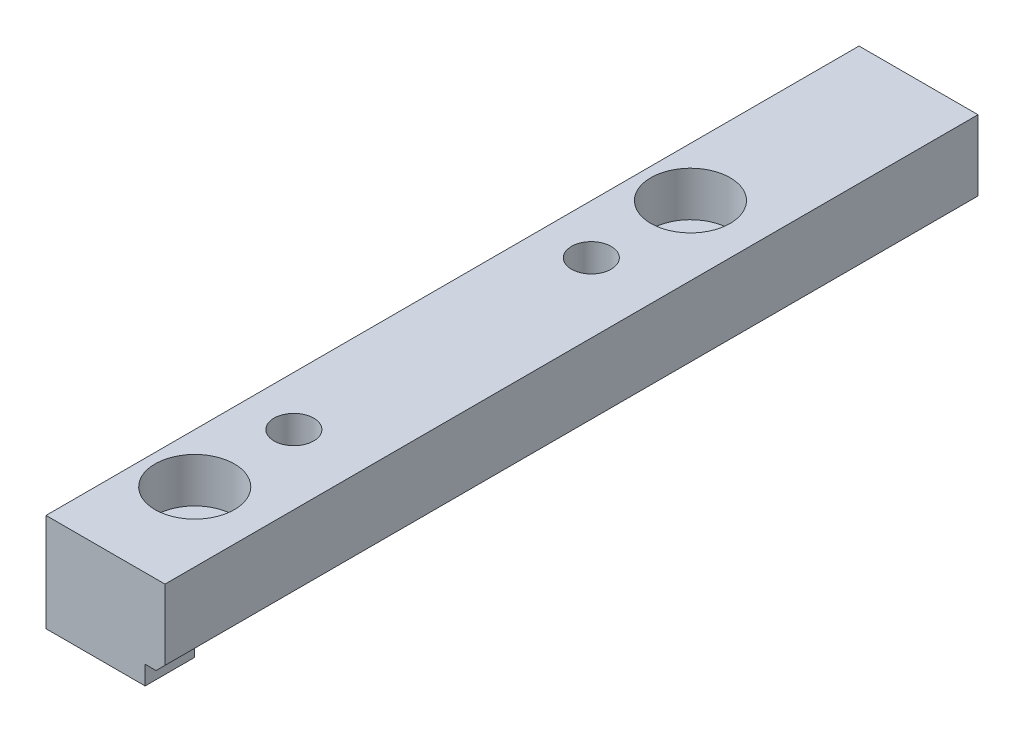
ISO-10303-21;
HEADER;
FILE_DESCRIPTION(('STEP AP214'),'2;1');
FILE_NAME('part.step','',(''),(''),'','','');
FILE_SCHEMA(('AUTOMOTIVE_DESIGN { 1 0 10303 214 1 1 1 1 }'));
ENDSEC;
DATA;
#1=APPLICATION_CONTEXT('core data for automotive mechanical design processes');
#2=APPLICATION_PROTOCOL_DEFINITION('international standard','automotive_design',2000,#1);
#3=PRODUCT_CONTEXT('',#1,'mechanical');
#4=PRODUCT('Part','Part','',(#3));
#5=PRODUCT_RELATED_PRODUCT_CATEGORY('part','',(#4));
#6=PRODUCT_DEFINITION_FORMATION('','',#4);
#7=PRODUCT_DEFINITION_CONTEXT('part definition',#1,'design');
#8=PRODUCT_DEFINITION('design','',#6,#7);
#9=PRODUCT_DEFINITION_SHAPE('','',#8);
#10=(LENGTH_UNIT() NAMED_UNIT(*) SI_UNIT(.MILLI.,.METRE.));
#11=(NAMED_UNIT(*) PLANE_ANGLE_UNIT() SI_UNIT($,.RADIAN.));
#12=(NAMED_UNIT(*) SI_UNIT($,.STERADIAN.) SOLID_ANGLE_UNIT());
#13=UNCERTAINTY_MEASURE_WITH_UNIT(LENGTH_MEASURE(1.E-05),#10,'distance_accuracy_value','');
#14=(GEOMETRIC_REPRESENTATION_CONTEXT(3) GLOBAL_UNCERTAINTY_ASSIGNED_CONTEXT((#13)) GLOBAL_UNIT_ASSIGNED_CONTEXT((#10,
#11,#12)) REPRESENTATION_CONTEXT('',''));
#15=CARTESIAN_POINT('',(0.,0.,0.));
#16=DIRECTION('',(0.,0.,1.));
#17=DIRECTION('',(1.,0.,0.));
#18=AXIS2_PLACEMENT_3D('',#15,#16,#17);
#19=CARTESIAN_POINT('',(5.,-72.1000000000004,72.));
#20=DIRECTION('',(0.,1.,0.));
#21=DIRECTION('',(0.,0.,1.));
#22=AXIS2_PLACEMENT_3D('',#19,#20,#21);
#23=CYLINDRICAL_SURFACE('',#22,2.25);
#24=CARTESIAN_POINT('',(5.,1.89999999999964,72.));
#25=DIRECTION('',(0.,1.,0.));
#26=DIRECTION('',(0.,0.,1.));
#27=AXIS2_PLACEMENT_3D('',#24,#25,#26);
#28=CIRCLE('',#27,2.25);
#29=CARTESIAN_POINT('',(5.,1.89999999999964,74.25));
#30=VERTEX_POINT('',#29);
#31=EDGE_CURVE('E147',#30,#30,#28,.T.);
#32=ORIENTED_EDGE('',*,*,#31,.F.);
#33=EDGE_LOOP('',(#32));
#34=FACE_BOUND('',#33,.T.);
#35=CARTESIAN_POINT('',(5.,5.39999999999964,72.));
#36=DIRECTION('',(0.,1.,0.));
#37=DIRECTION('',(0.,0.,1.));
#38=AXIS2_PLACEMENT_3D('',#35,#36,#37);
#39=CIRCLE('',#38,2.25);
#40=CARTESIAN_POINT('',(5.,5.39999999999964,74.25));
#41=VERTEX_POINT('',#40);
#42=EDGE_CURVE('E37',#41,#41,#39,.F.);
#43=ORIENTED_EDGE('',*,*,#42,.F.);
#44=EDGE_LOOP('',(#43));
#45=FACE_BOUND('',#44,.T.);
#46=ADVANCED_FACE('F33',(#34,#45),#23,.F.);
#47=CARTESIAN_POINT('',(5.,-72.1000000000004,22.));
#48=DIRECTION('',(0.,1.,0.));
#49=DIRECTION('',(0.,0.,1.));
#50=AXIS2_PLACEMENT_3D('',#47,#48,#49);
#51=CYLINDRICAL_SURFACE('',#50,2.25);
#52=CARTESIAN_POINT('',(5.,1.89999999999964,22.));
#53=DIRECTION('',(0.,1.,0.));
#54=DIRECTION('',(0.,0.,1.));
#55=AXIS2_PLACEMENT_3D('',#52,#53,#54);
#56=CIRCLE('',#55,2.25);
#57=CARTESIAN_POINT('',(5.,1.89999999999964,24.25));
#58=VERTEX_POINT('',#57);
#59=EDGE_CURVE('E152',#58,#58,#56,.T.);
#60=ORIENTED_EDGE('',*,*,#59,.F.);
#61=EDGE_LOOP('',(#60));
#62=FACE_BOUND('',#61,.T.);
#63=CARTESIAN_POINT('',(5.,5.39999999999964,22.));
#64=DIRECTION('',(0.,1.,0.));
#65=DIRECTION('',(0.,0.,1.));
#66=AXIS2_PLACEMENT_3D('',#63,#64,#65);
#67=CIRCLE('',#66,2.25);
#68=CARTESIAN_POINT('',(5.,5.39999999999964,24.25));
#69=VERTEX_POINT('',#68);
#70=EDGE_CURVE('E145',#69,#69,#67,.F.);
#71=ORIENTED_EDGE('',*,*,#70,.F.);
#72=EDGE_LOOP('',(#71));
#73=FACE_BOUND('',#72,.T.);
#74=ADVANCED_FACE('F217',(#62,#73),#51,.F.);
#75=CARTESIAN_POINT('',(-9.09494701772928E-13,0.,82.));
#76=DIRECTION('',(0.,1.,0.));
#77=DIRECTION('',(0.,0.,1.));
#78=AXIS2_PLACEMENT_3D('',#75,#76,#77);
#79=PLANE('',#78);
#80=DIRECTION('',(1.,0.,0.));
#81=VECTOR('',#80,1.);
#82=CARTESIAN_POINT('',(-70.0000000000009,0.,77.));
#83=LINE('',#82,#81);
#84=CARTESIAN_POINT('',(-9.15933995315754E-13,0.,77.));
#85=VERTEX_POINT('',#84);
#86=CARTESIAN_POINT('',(9.99999999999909,0.,77.));
#87=VERTEX_POINT('',#86);
#88=EDGE_CURVE('E167',#85,#87,#83,.T.);
#89=ORIENTED_EDGE('',*,*,#88,.T.);
#90=DIRECTION('',(0.,0.,-1.));
#91=VECTOR('',#90,1.);
#92=CARTESIAN_POINT('',(9.99999999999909,0.,82.));
#93=LINE('',#92,#91);
#94=CARTESIAN_POINT('',(9.99999999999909,0.,82.));
#95=VERTEX_POINT('',#94);
#96=EDGE_CURVE('E42',#95,#87,#93,.T.);
#97=ORIENTED_EDGE('',*,*,#96,.F.);
#98=DIRECTION('',(1.,0.,0.));
#99=VECTOR('',#98,1.);
#100=CARTESIAN_POINT('',(-9.09494701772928E-13,0.,82.));
#101=LINE('',#100,#99);
#102=CARTESIAN_POINT('',(-9.09494701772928E-13,0.,82.));
#103=VERTEX_POINT('',#102);
#104=EDGE_CURVE('E135',#103,#95,#101,.T.);
#105=ORIENTED_EDGE('',*,*,#104,.F.);
#106=DIRECTION('',(0.,0.,-1.));
#107=VECTOR('',#106,1.);
#108=CARTESIAN_POINT('',(-9.09494701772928E-13,0.,82.));
#109=LINE('',#108,#107);
#110=EDGE_CURVE('E122',#103,#85,#109,.T.);
#111=ORIENTED_EDGE('',*,*,#110,.T.);
#112=EDGE_LOOP('',(#89,#97,#105,#111));
#113=FACE_BOUND('',#112,.T.);
#114=ADVANCED_FACE('F35',(#113),#79,.F.);
#115=CARTESIAN_POINT('',(9.99999999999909,0.,82.));
#116=DIRECTION('',(-1.,0.,0.));
#117=DIRECTION('',(0.,0.,1.));
#118=AXIS2_PLACEMENT_3D('',#115,#116,#117);
#119=PLANE('',#118);
#120=DIRECTION('',(0.,-1.,0.));
#121=VECTOR('',#120,1.);
#122=CARTESIAN_POINT('',(9.99999999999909,0.,77.));
#123=LINE('',#122,#121);
#124=CARTESIAN_POINT('',(9.99999999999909,1.89999999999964,77.));
#125=VERTEX_POINT('',#124);
#126=EDGE_CURVE('E128',#125,#87,#123,.T.);
#127=ORIENTED_EDGE('',*,*,#126,.F.);
#128=DIRECTION('',(0.,0.,-1.));
#129=VECTOR('',#128,1.);
#130=CARTESIAN_POINT('',(9.99999999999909,1.89999999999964,82.));
#131=LINE('',#130,#129);
#132=CARTESIAN_POINT('',(9.99999999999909,1.89999999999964,82.));
#133=VERTEX_POINT('',#132);
#134=EDGE_CURVE('E142',#133,#125,#131,.T.);
#135=ORIENTED_EDGE('',*,*,#134,.F.);
#136=DIRECTION('',(0.,1.,0.));
#137=VECTOR('',#136,1.);
#138=CARTESIAN_POINT('',(9.99999999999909,0.,82.));
#139=LINE('',#138,#137);
#140=EDGE_CURVE('E90',#95,#133,#139,.T.);
#141=ORIENTED_EDGE('',*,*,#140,.F.);
#142=ORIENTED_EDGE('',*,*,#96,.T.);
#143=EDGE_LOOP('',(#127,#135,#141,#142));
#144=FACE_BOUND('',#143,.T.);
#145=ADVANCED_FACE('F198',(#144),#119,.F.);
#146=CARTESIAN_POINT('',(-9.09494701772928E-13,0.,82.));
#147=DIRECTION('',(1.,0.,0.));
#148=DIRECTION('',(0.,0.,-1.));
#149=AXIS2_PLACEMENT_3D('',#146,#147,#148);
#150=PLANE('',#149);
#151=DIRECTION('',(0.,0.,-1.));
#152=VECTOR('',#151,1.);
#153=CARTESIAN_POINT('',(-9.09494701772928E-13,1.89999999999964,82.));
#154=LINE('',#153,#152);
#155=CARTESIAN_POINT('',(-9.15933995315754E-13,1.89999999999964,77.));
#156=VERTEX_POINT('',#155);
#157=CARTESIAN_POINT('',(-9.09494701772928E-13,1.89999999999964,0.));
#158=VERTEX_POINT('',#157);
#159=EDGE_CURVE('E171',#156,#158,#154,.T.);
#160=ORIENTED_EDGE('',*,*,#159,.F.);
#161=DIRECTION('',(0.,1.,0.));
#162=VECTOR('',#161,1.);
#163=CARTESIAN_POINT('',(-9.09494701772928E-13,0.,77.));
#164=LINE('',#163,#162);
#165=EDGE_CURVE('E12',#85,#156,#164,.T.);
#166=ORIENTED_EDGE('',*,*,#165,.F.);
#167=ORIENTED_EDGE('',*,*,#110,.F.);
#168=DIRECTION('',(0.,-1.,0.));
#169=VECTOR('',#168,1.);
#170=CARTESIAN_POINT('',(-9.09494701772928E-13,0.,82.));
#171=LINE('',#170,#169);
#172=CARTESIAN_POINT('',(-9.09494701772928E-13,9.89999999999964,82.));
#173=VERTEX_POINT('',#172);
#174=EDGE_CURVE('E59',#173,#103,#171,.T.);
#175=ORIENTED_EDGE('',*,*,#174,.F.);
#176=DIRECTION('',(0.,0.,-1.));
#177=VECTOR('',#176,1.);
#178=CARTESIAN_POINT('',(-9.09494701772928E-13,9.89999999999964,82.));
#179=LINE('',#178,#177);
#180=CARTESIAN_POINT('',(-9.09494701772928E-13,9.89999999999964,0.));
#181=VERTEX_POINT('',#180);
#182=EDGE_CURVE('E118',#173,#181,#179,.T.);
#183=ORIENTED_EDGE('',*,*,#182,.T.);
#184=DIRECTION('',(0.,-1.,0.));
#185=VECTOR('',#184,1.);
#186=CARTESIAN_POINT('',(-9.09494701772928E-13,0.,0.));
#187=LINE('',#186,#185);
#188=EDGE_CURVE('E132',#181,#158,#187,.T.);
#189=ORIENTED_EDGE('',*,*,#188,.T.);
#190=EDGE_LOOP('',(#160,#166,#167,#175,#183,#189));
#191=FACE_BOUND('',#190,.T.);
#192=ADVANCED_FACE('F189',(#191),#150,.F.);
#193=CARTESIAN_POINT('',(9.99999999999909,0.,0.));
#194=DIRECTION('',(0.,0.,1.));
#195=DIRECTION('',(1.,0.,0.));
#196=AXIS2_PLACEMENT_3D('',#193,#194,#195);
#197=PLANE('',#196);
#198=DIRECTION('',(1.,0.,0.));
#199=VECTOR('',#198,1.);
#200=CARTESIAN_POINT('',(9.99999999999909,1.89999999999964,0.));
#201=LINE('',#200,#199);
#202=CARTESIAN_POINT('',(11.0999999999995,1.89999999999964,0.));
#203=VERTEX_POINT('',#202);
#204=EDGE_CURVE('E50',#158,#203,#201,.T.);
#205=ORIENTED_EDGE('',*,*,#204,.F.);
#206=ORIENTED_EDGE('',*,*,#188,.F.);
#207=DIRECTION('',(-1.,0.,0.));
#208=VECTOR('',#207,1.);
#209=CARTESIAN_POINT('',(-9.09494701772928E-13,9.89999999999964,0.));
#210=LINE('',#209,#208);
#211=CARTESIAN_POINT('',(11.9999999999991,9.89999999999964,0.));
#212=VERTEX_POINT('',#211);
#213=EDGE_CURVE('E81',#212,#181,#210,.T.);
#214=ORIENTED_EDGE('',*,*,#213,.F.);
#215=DIRECTION('',(0.,1.,0.));
#216=VECTOR('',#215,1.);
#217=CARTESIAN_POINT('',(11.9999999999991,2.79999999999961,0.));
#218=LINE('',#217,#216);
#219=CARTESIAN_POINT('',(11.9999999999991,2.79999999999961,0.));
#220=VERTEX_POINT('',#219);
#221=EDGE_CURVE('E116',#220,#212,#218,.T.);
#222=ORIENTED_EDGE('',*,*,#221,.F.);
#223=DIRECTION('',(0.707106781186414,0.707106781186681,0.));
#224=VECTOR('',#223,1.);
#225=CARTESIAN_POINT('',(11.0999999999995,1.89999999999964,0.));
#226=LINE('',#225,#224);
#227=EDGE_CURVE('E127',#203,#220,#226,.T.);
#228=ORIENTED_EDGE('',*,*,#227,.F.);
#229=EDGE_LOOP('',(#205,#206,#214,#222,#228));
#230=FACE_BOUND('',#229,.T.);
#231=ADVANCED_FACE('F186',(#230),#197,.F.);
#232=CARTESIAN_POINT('',(9.99999999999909,1.89999999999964,82.));
#233=DIRECTION('',(0.,1.,0.));
#234=DIRECTION('',(0.,0.,1.));
#235=AXIS2_PLACEMENT_3D('',#232,#233,#234);
#236=PLANE('',#235);
#237=CARTESIAN_POINT('',(5.,1.89999999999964,62.));
#238=DIRECTION('',(0.,1.,0.));
#239=DIRECTION('',(0.,0.,1.));
#240=AXIS2_PLACEMENT_3D('',#237,#238,#239);
#241=CIRCLE('',#240,2.00000000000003);
#242=CARTESIAN_POINT('',(5.,1.89999999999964,64.));
#243=VERTEX_POINT('',#242);
#244=EDGE_CURVE('E253',#243,#243,#241,.T.);
#245=ORIENTED_EDGE('',*,*,#244,.T.);
#246=EDGE_LOOP('',(#245));
#247=FACE_BOUND('',#246,.T.);
#248=CARTESIAN_POINT('',(5.,1.89999999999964,32.));
#249=DIRECTION('',(0.,1.,0.));
#250=DIRECTION('',(0.,0.,1.));
#251=AXIS2_PLACEMENT_3D('',#248,#249,#250);
#252=CIRCLE('',#251,2.00000000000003);
#253=CARTESIAN_POINT('',(5.,1.89999999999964,34.));
#254=VERTEX_POINT('',#253);
#255=EDGE_CURVE('E258',#254,#254,#252,.T.);
#256=ORIENTED_EDGE('',*,*,#255,.T.);
#257=EDGE_LOOP('',(#256));
#258=FACE_BOUND('',#257,.T.);
#259=ORIENTED_EDGE('',*,*,#31,.T.);
#260=EDGE_LOOP('',(#259));
#261=FACE_BOUND('',#260,.T.);
#262=ORIENTED_EDGE('',*,*,#59,.T.);
#263=EDGE_LOOP('',(#262));
#264=FACE_BOUND('',#263,.T.);
#265=ORIENTED_EDGE('',*,*,#204,.T.);
#266=DIRECTION('',(0.,0.,-1.));
#267=VECTOR('',#266,1.);
#268=CARTESIAN_POINT('',(11.0999999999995,1.89999999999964,82.));
#269=LINE('',#268,#267);
#270=CARTESIAN_POINT('',(11.0999999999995,1.89999999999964,82.));
#271=VERTEX_POINT('',#270);
#272=EDGE_CURVE('E140',#271,#203,#269,.T.);
#273=ORIENTED_EDGE('',*,*,#272,.F.);
#274=DIRECTION('',(1.,0.,0.));
#275=VECTOR('',#274,1.);
#276=CARTESIAN_POINT('',(9.99999999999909,1.89999999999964,82.));
#277=LINE('',#276,#275);
#278=EDGE_CURVE('E179',#133,#271,#277,.T.);
#279=ORIENTED_EDGE('',*,*,#278,.F.);
#280=ORIENTED_EDGE('',*,*,#134,.T.);
#281=DIRECTION('',(1.,0.,0.));
#282=VECTOR('',#281,1.);
#283=CARTESIAN_POINT('',(-70.0000000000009,1.89999999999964,77.));
#284=LINE('',#283,#282);
#285=EDGE_CURVE('E168',#156,#125,#284,.T.);
#286=ORIENTED_EDGE('',*,*,#285,.F.);
#287=ORIENTED_EDGE('',*,*,#159,.T.);
#288=EDGE_LOOP('',(#265,#273,#279,#280,#286,#287));
#289=FACE_BOUND('',#288,.T.);
#290=ADVANCED_FACE('F183',(#247,#258,#261,#264,#289),#236,.F.);
#291=CARTESIAN_POINT('',(11.0999999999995,1.89999999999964,82.));
#292=DIRECTION('',(-0.707106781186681,0.707106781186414,0.));
#293=DIRECTION('',(-0.707106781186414,-0.707106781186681,0.));
#294=AXIS2_PLACEMENT_3D('',#291,#292,#293);
#295=PLANE('',#294);
#296=ORIENTED_EDGE('',*,*,#227,.T.);
#297=DIRECTION('',(0.,0.,-1.));
#298=VECTOR('',#297,1.);
#299=CARTESIAN_POINT('',(11.9999999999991,2.79999999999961,82.));
#300=LINE('',#299,#298);
#301=CARTESIAN_POINT('',(11.9999999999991,2.79999999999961,82.));
#302=VERTEX_POINT('',#301);
#303=EDGE_CURVE('E117',#302,#220,#300,.T.);
#304=ORIENTED_EDGE('',*,*,#303,.F.);
#305=DIRECTION('',(0.707106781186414,0.707106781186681,0.));
#306=VECTOR('',#305,1.);
#307=CARTESIAN_POINT('',(11.0999999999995,1.89999999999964,82.));
#308=LINE('',#307,#306);
#309=EDGE_CURVE('E108',#271,#302,#308,.T.);
#310=ORIENTED_EDGE('',*,*,#309,.F.);
#311=ORIENTED_EDGE('',*,*,#272,.T.);
#312=EDGE_LOOP('',(#296,#304,#310,#311));
#313=FACE_BOUND('',#312,.T.);
#314=ADVANCED_FACE('F185',(#313),#295,.F.);
#315=CARTESIAN_POINT('',(11.9999999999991,2.79999999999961,82.));
#316=DIRECTION('',(-1.,0.,0.));
#317=DIRECTION('',(0.,0.,1.));
#318=AXIS2_PLACEMENT_3D('',#315,#316,#317);
#319=PLANE('',#318);
#320=ORIENTED_EDGE('',*,*,#221,.T.);
#321=DIRECTION('',(0.,0.,-1.));
#322=VECTOR('',#321,1.);
#323=CARTESIAN_POINT('',(11.9999999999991,9.89999999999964,82.));
#324=LINE('',#323,#322);
#325=CARTESIAN_POINT('',(11.9999999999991,9.89999999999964,82.));
#326=VERTEX_POINT('',#325);
#327=EDGE_CURVE('E113',#326,#212,#324,.T.);
#328=ORIENTED_EDGE('',*,*,#327,.F.);
#329=DIRECTION('',(0.,1.,0.));
#330=VECTOR('',#329,1.);
#331=CARTESIAN_POINT('',(11.9999999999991,2.79999999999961,82.));
#332=LINE('',#331,#330);
#333=EDGE_CURVE('E102',#302,#326,#332,.T.);
#334=ORIENTED_EDGE('',*,*,#333,.F.);
#335=ORIENTED_EDGE('',*,*,#303,.T.);
#336=EDGE_LOOP('',(#320,#328,#334,#335));
#337=FACE_BOUND('',#336,.T.);
#338=ADVANCED_FACE('F114',(#337),#319,.F.);
#339=CARTESIAN_POINT('',(-9.09494701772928E-13,9.89999999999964,82.));
#340=DIRECTION('',(0.,-1.,0.));
#341=DIRECTION('',(0.,0.,-1.));
#342=AXIS2_PLACEMENT_3D('',#339,#340,#341);
#343=PLANE('',#342);
#344=CARTESIAN_POINT('',(5.,9.89999999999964,62.));
#345=DIRECTION('',(0.,1.,0.));
#346=DIRECTION('',(0.,0.,1.));
#347=AXIS2_PLACEMENT_3D('',#344,#345,#346);
#348=CIRCLE('',#347,2.00000000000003);
#349=CARTESIAN_POINT('',(5.,9.89999999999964,64.));
#350=VERTEX_POINT('',#349);
#351=EDGE_CURVE('E250',#350,#350,#348,.T.);
#352=ORIENTED_EDGE('',*,*,#351,.F.);
#353=EDGE_LOOP('',(#352));
#354=FACE_BOUND('',#353,.T.);
#355=CARTESIAN_POINT('',(5.,9.89999999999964,32.));
#356=DIRECTION('',(0.,1.,0.));
#357=DIRECTION('',(0.,0.,1.));
#358=AXIS2_PLACEMENT_3D('',#355,#356,#357);
#359=CIRCLE('',#358,2.00000000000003);
#360=CARTESIAN_POINT('',(5.,9.89999999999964,34.));
#361=VERTEX_POINT('',#360);
#362=EDGE_CURVE('E255',#361,#361,#359,.T.);
#363=ORIENTED_EDGE('',*,*,#362,.F.);
#364=EDGE_LOOP('',(#363));
#365=FACE_BOUND('',#364,.T.);
#366=CARTESIAN_POINT('',(5.,9.89999999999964,72.));
#367=DIRECTION('',(0.,1.,0.));
#368=DIRECTION('',(0.,0.,1.));
#369=AXIS2_PLACEMENT_3D('',#366,#367,#368);
#370=CIRCLE('',#369,4.);
#371=CARTESIAN_POINT('',(5.,9.89999999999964,76.));
#372=VERTEX_POINT('',#371);
#373=EDGE_CURVE('E162',#372,#372,#370,.T.);
#374=ORIENTED_EDGE('',*,*,#373,.F.);
#375=EDGE_LOOP('',(#374));
#376=FACE_BOUND('',#375,.T.);
#377=CARTESIAN_POINT('',(5.,9.89999999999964,22.));
#378=DIRECTION('',(0.,1.,0.));
#379=DIRECTION('',(0.,0.,1.));
#380=AXIS2_PLACEMENT_3D('',#377,#378,#379);
#381=CIRCLE('',#380,4.);
#382=CARTESIAN_POINT('',(5.,9.89999999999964,26.));
#383=VERTEX_POINT('',#382);
#384=EDGE_CURVE('E155',#383,#383,#381,.T.);
#385=ORIENTED_EDGE('',*,*,#384,.F.);
#386=EDGE_LOOP('',(#385));
#387=FACE_BOUND('',#386,.T.);
#388=ORIENTED_EDGE('',*,*,#213,.T.);
#389=ORIENTED_EDGE('',*,*,#182,.F.);
#390=DIRECTION('',(-1.,0.,0.));
#391=VECTOR('',#390,1.);
#392=CARTESIAN_POINT('',(-9.09494701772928E-13,9.89999999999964,82.));
#393=LINE('',#392,#391);
#394=EDGE_CURVE('E106',#326,#173,#393,.T.);
#395=ORIENTED_EDGE('',*,*,#394,.F.);
#396=ORIENTED_EDGE('',*,*,#327,.T.);
#397=EDGE_LOOP('',(#388,#389,#395,#396));
#398=FACE_BOUND('',#397,.T.);
#399=ADVANCED_FACE('F120',(#354,#365,#376,#387,#398),#343,.F.);
#400=CARTESIAN_POINT('',(9.99999999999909,0.,82.));
#401=DIRECTION('',(0.,0.,1.));
#402=DIRECTION('',(1.,0.,0.));
#403=AXIS2_PLACEMENT_3D('',#400,#401,#402);
#404=PLANE('',#403);
#405=ORIENTED_EDGE('',*,*,#104,.T.);
#406=ORIENTED_EDGE('',*,*,#140,.T.);
#407=ORIENTED_EDGE('',*,*,#278,.T.);
#408=ORIENTED_EDGE('',*,*,#309,.T.);
#409=ORIENTED_EDGE('',*,*,#333,.T.);
#410=ORIENTED_EDGE('',*,*,#394,.T.);
#411=ORIENTED_EDGE('',*,*,#174,.T.);
#412=EDGE_LOOP('',(#405,#406,#407,#408,#409,#410,#411));
#413=FACE_BOUND('',#412,.T.);
#414=ADVANCED_FACE('F104',(#413),#404,.T.);
#415=CARTESIAN_POINT('',(-70.0000000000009,0.,77.));
#416=DIRECTION('',(0.,0.,-1.));
#417=DIRECTION('',(-1.,0.,0.));
#418=AXIS2_PLACEMENT_3D('',#415,#416,#417);
#419=PLANE('',#418);
#420=ORIENTED_EDGE('',*,*,#126,.T.);
#421=ORIENTED_EDGE('',*,*,#88,.F.);
#422=ORIENTED_EDGE('',*,*,#165,.T.);
#423=ORIENTED_EDGE('',*,*,#285,.T.);
#424=EDGE_LOOP('',(#420,#421,#422,#423));
#425=FACE_BOUND('',#424,.T.);
#426=ADVANCED_FACE('F204',(#425),#419,.T.);
#427=CARTESIAN_POINT('',(5.,5.39999999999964,22.));
#428=DIRECTION('',(0.,1.,0.));
#429=DIRECTION('',(0.,0.,1.));
#430=AXIS2_PLACEMENT_3D('',#427,#428,#429);
#431=PLANE('',#430);
#432=CARTESIAN_POINT('',(5.,5.39999999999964,22.));
#433=DIRECTION('',(0.,1.,0.));
#434=DIRECTION('',(0.,0.,1.));
#435=AXIS2_PLACEMENT_3D('',#432,#433,#434);
#436=CIRCLE('',#435,4.);
#437=CARTESIAN_POINT('',(5.,5.39999999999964,26.));
#438=VERTEX_POINT('',#437);
#439=EDGE_CURVE('E148',#438,#438,#436,.T.);
#440=ORIENTED_EDGE('',*,*,#439,.T.);
#441=EDGE_LOOP('',(#440));
#442=FACE_BOUND('',#441,.T.);
#443=ORIENTED_EDGE('',*,*,#70,.T.);
#444=EDGE_LOOP('',(#443));
#445=FACE_BOUND('',#444,.T.);
#446=ADVANCED_FACE('F206',(#442,#445),#431,.T.);
#447=CARTESIAN_POINT('',(5.,5.39999999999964,22.));
#448=DIRECTION('',(0.,1.,0.));
#449=DIRECTION('',(0.,0.,1.));
#450=AXIS2_PLACEMENT_3D('',#447,#448,#449);
#451=CYLINDRICAL_SURFACE('',#450,4.);
#452=ORIENTED_EDGE('',*,*,#439,.F.);
#453=EDGE_LOOP('',(#452));
#454=FACE_BOUND('',#453,.T.);
#455=ORIENTED_EDGE('',*,*,#384,.T.);
#456=EDGE_LOOP('',(#455));
#457=FACE_BOUND('',#456,.T.);
#458=ADVANCED_FACE('F212',(#454,#457),#451,.F.);
#459=CARTESIAN_POINT('',(5.,5.39999999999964,72.));
#460=DIRECTION('',(0.,1.,0.));
#461=DIRECTION('',(0.,0.,1.));
#462=AXIS2_PLACEMENT_3D('',#459,#460,#461);
#463=PLANE('',#462);
#464=CARTESIAN_POINT('',(5.,5.39999999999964,72.));
#465=DIRECTION('',(0.,1.,0.));
#466=DIRECTION('',(0.,0.,1.));
#467=AXIS2_PLACEMENT_3D('',#464,#465,#466);
#468=CIRCLE('',#467,4.);
#469=CARTESIAN_POINT('',(5.,5.39999999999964,76.));
#470=VERTEX_POINT('',#469);
#471=EDGE_CURVE('E263',#470,#470,#468,.T.);
#472=ORIENTED_EDGE('',*,*,#471,.T.);
#473=EDGE_LOOP('',(#472));
#474=FACE_BOUND('',#473,.T.);
#475=ORIENTED_EDGE('',*,*,#42,.T.);
#476=EDGE_LOOP('',(#475));
#477=FACE_BOUND('',#476,.T.);
#478=ADVANCED_FACE('F228',(#474,#477),#463,.T.);
#479=CARTESIAN_POINT('',(5.,5.39999999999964,72.));
#480=DIRECTION('',(0.,1.,0.));
#481=DIRECTION('',(0.,0.,1.));
#482=AXIS2_PLACEMENT_3D('',#479,#480,#481);
#483=CYLINDRICAL_SURFACE('',#482,4.);
#484=ORIENTED_EDGE('',*,*,#471,.F.);
#485=EDGE_LOOP('',(#484));
#486=FACE_BOUND('',#485,.T.);
#487=ORIENTED_EDGE('',*,*,#373,.T.);
#488=EDGE_LOOP('',(#487));
#489=FACE_BOUND('',#488,.T.);
#490=ADVANCED_FACE('F231',(#486,#489),#483,.F.);
#491=CARTESIAN_POINT('',(5.,0.,32.));
#492=DIRECTION('',(0.,1.,0.));
#493=DIRECTION('',(0.,0.,1.));
#494=AXIS2_PLACEMENT_3D('',#491,#492,#493);
#495=CYLINDRICAL_SURFACE('',#494,2.00000000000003);
#496=ORIENTED_EDGE('',*,*,#362,.T.);
#497=EDGE_LOOP('',(#496));
#498=FACE_BOUND('',#497,.T.);
#499=ORIENTED_EDGE('',*,*,#255,.F.);
#500=EDGE_LOOP('',(#499));
#501=FACE_BOUND('',#500,.T.);
#502=ADVANCED_FACE('F234',(#498,#501),#495,.F.);
#503=CARTESIAN_POINT('',(5.,0.,62.));
#504=DIRECTION('',(0.,1.,0.));
#505=DIRECTION('',(0.,0.,1.));
#506=AXIS2_PLACEMENT_3D('',#503,#504,#505);
#507=CYLINDRICAL_SURFACE('',#506,2.00000000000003);
#508=ORIENTED_EDGE('',*,*,#351,.T.);
#509=EDGE_LOOP('',(#508));
#510=FACE_BOUND('',#509,.T.);
#511=ORIENTED_EDGE('',*,*,#244,.F.);
#512=EDGE_LOOP('',(#511));
#513=FACE_BOUND('',#512,.T.);
#514=ADVANCED_FACE('F241',(#510,#513),#507,.F.);
#515=CLOSED_SHELL('',(#46,#74,#114,#145,#192,#231,#290,#314,#338,#399,#414,#426,#446,#458,#478,
#490,#502,#514));
#516=MANIFOLD_SOLID_BREP('B2',#515);
#517=ADVANCED_BREP_SHAPE_REPRESENTATION('',(#18,#516),#14);
#518=SHAPE_DEFINITION_REPRESENTATION(#9,#517);
ENDSEC;
END-ISO-10303-21;
